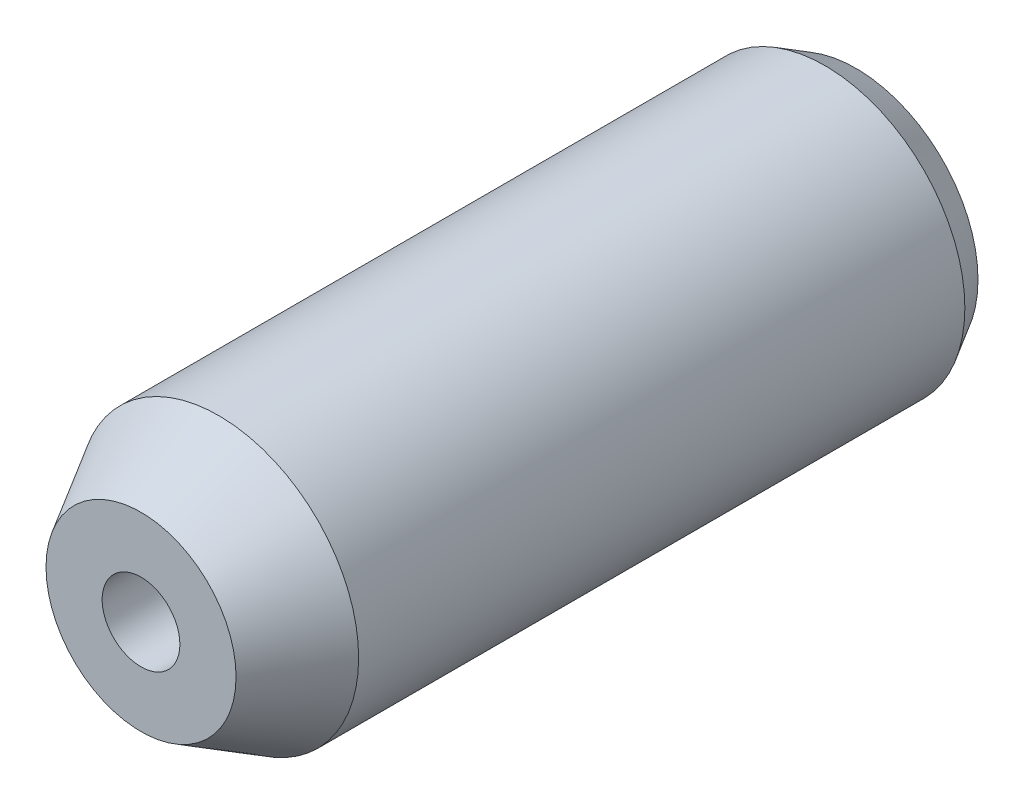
ISO-10303-21;
HEADER;
FILE_DESCRIPTION(('STEP AP214'),'2;1');
FILE_NAME('part.step','',(''),(''),'','','');
FILE_SCHEMA(('AUTOMOTIVE_DESIGN { 1 0 10303 214 1 1 1 1 }'));
ENDSEC;
DATA;
#1=APPLICATION_CONTEXT('core data for automotive mechanical design processes');
#2=APPLICATION_PROTOCOL_DEFINITION('international standard','automotive_design',2000,#1);
#3=PRODUCT_CONTEXT('',#1,'mechanical');
#4=PRODUCT('Part','Part','',(#3));
#5=PRODUCT_RELATED_PRODUCT_CATEGORY('part','',(#4));
#6=PRODUCT_DEFINITION_FORMATION('','',#4);
#7=PRODUCT_DEFINITION_CONTEXT('part definition',#1,'design');
#8=PRODUCT_DEFINITION('design','',#6,#7);
#9=PRODUCT_DEFINITION_SHAPE('','',#8);
#10=(LENGTH_UNIT() NAMED_UNIT(*) SI_UNIT(.MILLI.,.METRE.));
#11=(NAMED_UNIT(*) PLANE_ANGLE_UNIT() SI_UNIT($,.RADIAN.));
#12=(NAMED_UNIT(*) SI_UNIT($,.STERADIAN.) SOLID_ANGLE_UNIT());
#13=UNCERTAINTY_MEASURE_WITH_UNIT(LENGTH_MEASURE(1.E-05),#10,'distance_accuracy_value','');
#14=(GEOMETRIC_REPRESENTATION_CONTEXT(3) GLOBAL_UNCERTAINTY_ASSIGNED_CONTEXT((#13)) GLOBAL_UNIT_ASSIGNED_CONTEXT((#10,
#11,#12)) REPRESENTATION_CONTEXT('',''));
#15=CARTESIAN_POINT('',(0.,0.,0.));
#16=DIRECTION('',(0.,0.,1.));
#17=DIRECTION('',(1.,0.,0.));
#18=AXIS2_PLACEMENT_3D('',#15,#16,#17);
#19=CARTESIAN_POINT('',(0.,0.,0.));
#20=DIRECTION('',(0.,0.,1.));
#21=DIRECTION('',(1.,0.,0.));
#22=AXIS2_PLACEMENT_3D('',#19,#20,#21);
#23=PLANE('',#22);
#24=CARTESIAN_POINT('',(0.,0.,0.));
#25=DIRECTION('',(0.,0.,1.));
#26=DIRECTION('',(1.,0.,0.));
#27=AXIS2_PLACEMENT_3D('',#24,#25,#26);
#28=CIRCLE('',#27,7.84529946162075);
#29=CARTESIAN_POINT('',(7.84529946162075,0.,0.));
#30=VERTEX_POINT('',#29);
#31=EDGE_CURVE('E8',#30,#30,#28,.T.);
#32=ORIENTED_EDGE('',*,*,#31,.F.);
#33=EDGE_LOOP('',(#32));
#34=FACE_BOUND('',#33,.T.);
#35=ADVANCED_FACE('F13',(#34),#23,.F.);
#36=CARTESIAN_POINT('',(0.,0.,2.));
#37=DIRECTION('',(0.,0.,1.));
#38=DIRECTION('',(1.,0.,0.));
#39=AXIS2_PLACEMENT_3D('',#36,#37,#38);
#40=CONICAL_SURFACE('',#39,9.,0.523598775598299);
#41=ORIENTED_EDGE('',*,*,#31,.T.);
#42=EDGE_LOOP('',(#41));
#43=FACE_BOUND('',#42,.T.);
#44=CARTESIAN_POINT('',(0.,0.,2.));
#45=DIRECTION('',(0.,0.,1.));
#46=DIRECTION('',(1.,0.,0.));
#47=AXIS2_PLACEMENT_3D('',#44,#45,#46);
#48=CIRCLE('',#47,9.);
#49=CARTESIAN_POINT('',(9.,0.,2.));
#50=VERTEX_POINT('',#49);
#51=EDGE_CURVE('E19',#50,#50,#48,.T.);
#52=ORIENTED_EDGE('',*,*,#51,.F.);
#53=EDGE_LOOP('',(#52));
#54=FACE_BOUND('',#53,.T.);
#55=ADVANCED_FACE('F61',(#43,#54),#40,.T.);
#56=CARTESIAN_POINT('',(0.,0.,50.));
#57=DIRECTION('',(0.,0.,1.));
#58=DIRECTION('',(1.,0.,0.));
#59=AXIS2_PLACEMENT_3D('',#56,#57,#58);
#60=CYLINDRICAL_SURFACE('',#59,9.);
#61=CARTESIAN_POINT('',(0.,0.,41.));
#62=DIRECTION('',(0.,0.,1.));
#63=DIRECTION('',(1.,0.,0.));
#64=AXIS2_PLACEMENT_3D('',#61,#62,#63);
#65=CIRCLE('',#64,9.);
#66=CARTESIAN_POINT('',(9.,0.,41.));
#67=VERTEX_POINT('',#66);
#68=EDGE_CURVE('E23',#67,#67,#65,.T.);
#69=ORIENTED_EDGE('',*,*,#68,.F.);
#70=EDGE_LOOP('',(#69));
#71=FACE_BOUND('',#70,.T.);
#72=ORIENTED_EDGE('',*,*,#51,.T.);
#73=EDGE_LOOP('',(#72));
#74=FACE_BOUND('',#73,.T.);
#75=ADVANCED_FACE('F56',(#71,#74),#60,.T.);
#76=CARTESIAN_POINT('',(0.,0.,41.));
#77=DIRECTION('',(0.,0.,-1.));
#78=DIRECTION('',(-1.,0.,0.));
#79=AXIS2_PLACEMENT_3D('',#76,#77,#78);
#80=CONICAL_SURFACE('',#79,9.,0.523598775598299);
#81=CARTESIAN_POINT('',(0.,0.,46.));
#82=DIRECTION('',(0.,0.,1.));
#83=DIRECTION('',(1.,0.,0.));
#84=AXIS2_PLACEMENT_3D('',#81,#82,#83);
#85=CIRCLE('',#84,6.11324865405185);
#86=CARTESIAN_POINT('',(6.11324865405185,0.,46.));
#87=VERTEX_POINT('',#86);
#88=EDGE_CURVE('E27',#87,#87,#85,.T.);
#89=ORIENTED_EDGE('',*,*,#88,.F.);
#90=EDGE_LOOP('',(#89));
#91=FACE_BOUND('',#90,.T.);
#92=ORIENTED_EDGE('',*,*,#68,.T.);
#93=EDGE_LOOP('',(#92));
#94=FACE_BOUND('',#93,.T.);
#95=ADVANCED_FACE('F50',(#91,#94),#80,.T.);
#96=CARTESIAN_POINT('',(6.11324865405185,0.,46.));
#97=DIRECTION('',(0.,0.,-1.));
#98=DIRECTION('',(-1.,0.,0.));
#99=AXIS2_PLACEMENT_3D('',#96,#97,#98);
#100=PLANE('',#99);
#101=CARTESIAN_POINT('',(0.,0.,46.));
#102=DIRECTION('',(0.,0.,1.));
#103=DIRECTION('',(1.,0.,0.));
#104=AXIS2_PLACEMENT_3D('',#101,#102,#103);
#105=CIRCLE('',#104,2.5);
#106=CARTESIAN_POINT('',(2.5,0.,46.));
#107=VERTEX_POINT('',#106);
#108=EDGE_CURVE('E32',#107,#107,#105,.T.);
#109=ORIENTED_EDGE('',*,*,#108,.F.);
#110=EDGE_LOOP('',(#109));
#111=FACE_BOUND('',#110,.T.);
#112=ORIENTED_EDGE('',*,*,#88,.T.);
#113=EDGE_LOOP('',(#112));
#114=FACE_BOUND('',#113,.T.);
#115=ADVANCED_FACE('F44',(#111,#114),#100,.F.);
#116=CARTESIAN_POINT('',(0.,0.,50.));
#117=DIRECTION('',(0.,0.,1.));
#118=DIRECTION('',(1.,0.,0.));
#119=AXIS2_PLACEMENT_3D('',#116,#117,#118);
#120=CYLINDRICAL_SURFACE('',#119,2.5);
#121=CARTESIAN_POINT('',(0.,0.,36.));
#122=DIRECTION('',(0.,0.,1.));
#123=DIRECTION('',(1.,0.,0.));
#124=AXIS2_PLACEMENT_3D('',#121,#122,#123);
#125=CIRCLE('',#124,2.5);
#126=CARTESIAN_POINT('',(2.5,0.,36.));
#127=VERTEX_POINT('',#126);
#128=EDGE_CURVE('E35',#127,#127,#125,.T.);
#129=ORIENTED_EDGE('',*,*,#128,.F.);
#130=EDGE_LOOP('',(#129));
#131=FACE_BOUND('',#130,.T.);
#132=ORIENTED_EDGE('',*,*,#108,.T.);
#133=EDGE_LOOP('',(#132));
#134=FACE_BOUND('',#133,.T.);
#135=ADVANCED_FACE('F41',(#131,#134),#120,.F.);
#136=CARTESIAN_POINT('',(0.,0.,36.));
#137=DIRECTION('',(0.,0.,1.));
#138=DIRECTION('',(1.,0.,0.));
#139=AXIS2_PLACEMENT_3D('',#136,#137,#138);
#140=PLANE('',#139);
#141=ORIENTED_EDGE('',*,*,#128,.T.);
#142=EDGE_LOOP('',(#141));
#143=FACE_BOUND('',#142,.T.);
#144=ADVANCED_FACE('F39',(#143),#140,.T.);
#145=CLOSED_SHELL('',(#35,#55,#75,#95,#115,#135,#144));
#146=MANIFOLD_SOLID_BREP('B1',#145);
#147=ADVANCED_BREP_SHAPE_REPRESENTATION('',(#18,#146),#14);
#148=SHAPE_DEFINITION_REPRESENTATION(#9,#147);
ENDSEC;
END-ISO-10303-21;
